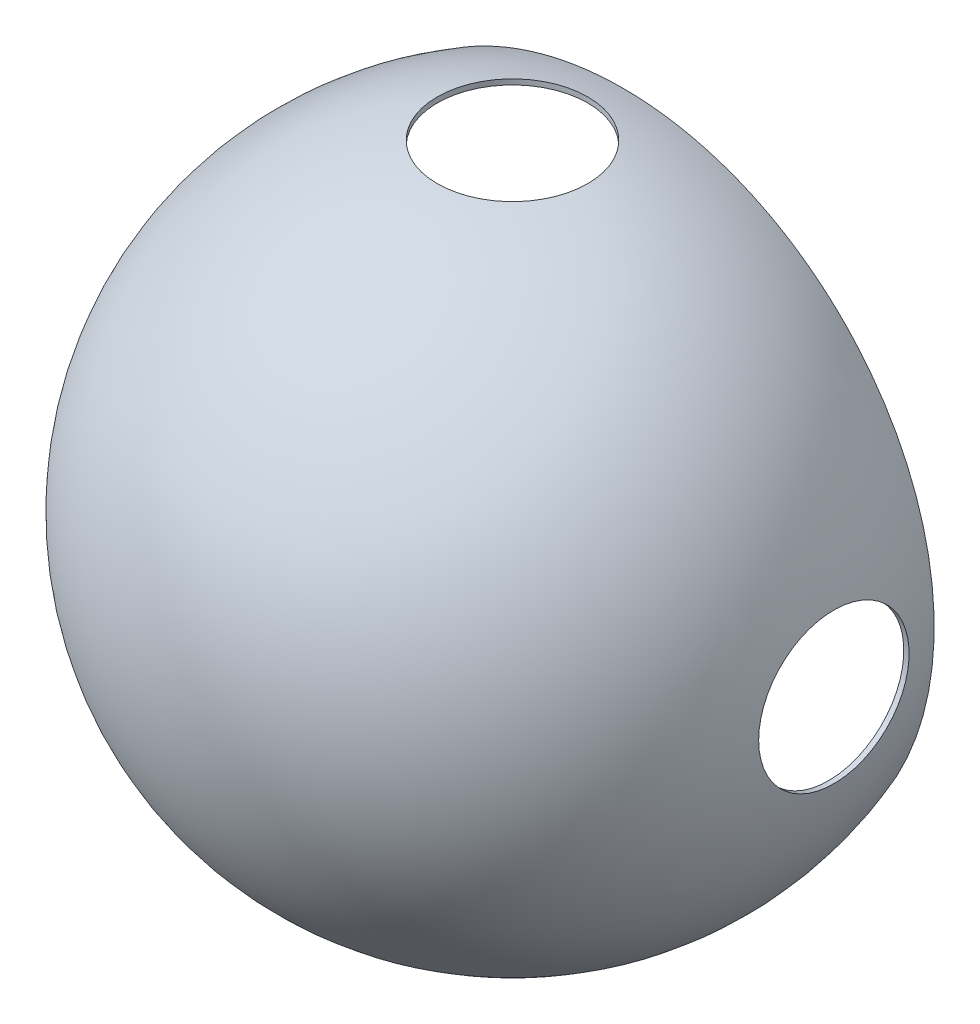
ISO-10303-21;
HEADER;
FILE_DESCRIPTION(('STEP AP214'),'2;1');
FILE_NAME('part.step','',(''),(''),'','','');
FILE_SCHEMA(('AUTOMOTIVE_DESIGN { 1 0 10303 214 1 1 1 1 }'));
ENDSEC;
DATA;
#1=APPLICATION_CONTEXT('core data for automotive mechanical design processes');
#2=APPLICATION_PROTOCOL_DEFINITION('international standard','automotive_design',2000,#1);
#3=PRODUCT_CONTEXT('',#1,'mechanical');
#4=PRODUCT('Part','Part','',(#3));
#5=PRODUCT_RELATED_PRODUCT_CATEGORY('part','',(#4));
#6=PRODUCT_DEFINITION_FORMATION('','',#4);
#7=PRODUCT_DEFINITION_CONTEXT('part definition',#1,'design');
#8=PRODUCT_DEFINITION('design','',#6,#7);
#9=PRODUCT_DEFINITION_SHAPE('','',#8);
#10=(LENGTH_UNIT() NAMED_UNIT(*) SI_UNIT(.MILLI.,.METRE.));
#11=(NAMED_UNIT(*) PLANE_ANGLE_UNIT() SI_UNIT($,.RADIAN.));
#12=(NAMED_UNIT(*) SI_UNIT($,.STERADIAN.) SOLID_ANGLE_UNIT());
#13=UNCERTAINTY_MEASURE_WITH_UNIT(LENGTH_MEASURE(1.E-05),#10,'distance_accuracy_value','');
#14=(GEOMETRIC_REPRESENTATION_CONTEXT(3) GLOBAL_UNCERTAINTY_ASSIGNED_CONTEXT((#13)) GLOBAL_UNIT_ASSIGNED_CONTEXT((#10,
#11,#12)) REPRESENTATION_CONTEXT('',''));
#15=CARTESIAN_POINT('',(0.,0.,0.));
#16=DIRECTION('',(0.,0.,1.));
#17=DIRECTION('',(1.,0.,0.));
#18=AXIS2_PLACEMENT_3D('',#15,#16,#17);
#19=CARTESIAN_POINT('',(2.4980018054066E-13,2.4980018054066E-13,0.));
#20=DIRECTION('',(-0.707106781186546,-0.707106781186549,0.));
#21=DIRECTION('',(0.707106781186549,-0.707106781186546,0.));
#22=AXIS2_PLACEMENT_3D('',#19,#20,#21);
#23=TOROIDAL_SURFACE('',#22,100.0125,3.175);
#24=CARTESIAN_POINT('',(-2.24478118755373,-2.24478118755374,0.));
#25=DIRECTION('',(-0.707106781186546,-0.707106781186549,0.));
#26=DIRECTION('',(0.707106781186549,-0.707106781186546,0.));
#27=AXIS2_PLACEMENT_3D('',#24,#25,#26);
#28=CIRCLE('',#27,99.9621031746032);
#29=CARTESIAN_POINT('',(64.9724812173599,-69.4620435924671,-30.9208884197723));
#30=VERTEX_POINT('',#29);
#31=CARTESIAN_POINT('',(-69.4620435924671,64.9724812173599,-30.9208884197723));
#32=VERTEX_POINT('',#31);
#33=EDGE_CURVE('E83',#30,#32,#28,.T.);
#34=ORIENTED_EDGE('',*,*,#33,.T.);
#35=CARTESIAN_POINT('',(-67.1710007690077,63.9959230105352,-30.9208884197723));
#36=CARTESIAN_POINT('',(-66.9942054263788,63.9912670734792,-30.9208884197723));
#37=CARTESIAN_POINT('',(-66.8169423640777,64.0009764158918,-30.9208884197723));
#38=CARTESIAN_POINT('',(-66.4663612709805,64.0496674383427,-30.9208884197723));
#39=CARTESIAN_POINT('',(-66.2930458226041,64.0886677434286,-30.9208884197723));
#40=CARTESIAN_POINT('',(-65.9552613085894,64.1956447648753,-30.9208884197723));
#41=CARTESIAN_POINT('',(-65.7908059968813,64.2636651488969,-30.9208884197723));
#42=CARTESIAN_POINT('',(-65.4762086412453,64.4272050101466,-30.9208884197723));
#43=CARTESIAN_POINT('',(-65.3260626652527,64.522716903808,-30.9208884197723));
#44=CARTESIAN_POINT('',(-65.0490542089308,64.7353837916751,-30.9208884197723));
#45=CARTESIAN_POINT('',(-64.9216315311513,64.8518096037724,-30.9208884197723));
#46=CARTESIAN_POINT('',(-64.6885399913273,65.1046969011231,-30.9208884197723));
#47=CARTESIAN_POINT('',(-64.582869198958,65.2411566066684,-30.9208884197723));
#48=CARTESIAN_POINT('',(-64.3976071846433,65.5278264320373,-30.9208884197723));
#49=CARTESIAN_POINT('',(-64.317648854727,65.6777998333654,-30.9208884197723));
#50=CARTESIAN_POINT('',(-64.1835100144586,65.9888428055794,-30.9208884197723));
#51=CARTESIAN_POINT('',(-64.1293310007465,66.1499130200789,-30.9208884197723));
#52=CARTESIAN_POINT('',(-64.0468454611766,66.4819335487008,-30.9208884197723));
#53=CARTESIAN_POINT('',(-64.0190754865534,66.6530167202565,-30.9208884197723));
#54=CARTESIAN_POINT('',(-63.9913391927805,66.9974059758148,-30.9208884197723));
#55=CARTESIAN_POINT('',(-63.9913781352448,67.1707124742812,-30.9208884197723));
#56=CARTESIAN_POINT('',(-64.0191839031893,67.5228611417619,-30.9208884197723));
#57=CARTESIAN_POINT('',(-64.0481876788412,67.7016053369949,-30.9208884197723));
#58=CARTESIAN_POINT('',(-64.1343318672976,68.0521717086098,-30.9208884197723));
#59=CARTESIAN_POINT('',(-64.191479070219,68.2239922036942,-30.9208884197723));
#60=CARTESIAN_POINT('',(-64.3354580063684,68.5648495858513,-30.9208884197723));
#61=CARTESIAN_POINT('',(-64.4236245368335,68.7333231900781,-30.9208884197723));
#62=CARTESIAN_POINT('',(-64.6260878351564,69.0537684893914,-30.9208884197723));
#63=CARTESIAN_POINT('',(-64.7403900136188,69.2057367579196,-30.9208884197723));
#64=CARTESIAN_POINT('',(-64.9962788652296,69.4940972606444,-30.9208884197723));
#65=CARTESIAN_POINT('',(-65.138660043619,69.6297856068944,-30.9208884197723));
#66=CARTESIAN_POINT('',(-65.4441096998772,69.875478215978,-30.9208884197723));
#67=CARTESIAN_POINT('',(-65.6071798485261,69.985480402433,-30.9208884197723));
#68=CARTESIAN_POINT('',(-65.9502315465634,70.1767145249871,-30.9208884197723));
#69=CARTESIAN_POINT('',(-66.1302738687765,70.2578376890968,-30.9208884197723));
#70=CARTESIAN_POINT('',(-66.5016940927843,70.3877564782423,-30.9208884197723));
#71=CARTESIAN_POINT('',(-66.6930706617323,70.4365558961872,-30.9208884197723));
#72=CARTESIAN_POINT('',(-67.0760453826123,70.4986648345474,-30.9208884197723));
#73=CARTESIAN_POINT('',(-67.2674885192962,70.5129261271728,-30.9208884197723));
#74=CARTESIAN_POINT('',(-67.6499040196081,70.5074527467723,-30.9208884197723));
#75=CARTESIAN_POINT('',(-67.8408764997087,70.4877275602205,-30.9208884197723));
#76=CARTESIAN_POINT('',(-68.2074277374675,70.4158061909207,-30.9208884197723));
#77=CARTESIAN_POINT('',(-68.3833098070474,70.3651561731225,-30.9208884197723));
#78=CARTESIAN_POINT('',(-68.7234225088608,70.2337063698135,-30.9208884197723));
#79=CARTESIAN_POINT('',(-68.8876564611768,70.1529152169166,-30.9208884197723));
#80=CARTESIAN_POINT('',(-69.1923319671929,69.9674474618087,-30.9208884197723));
#81=CARTESIAN_POINT('',(-69.3334953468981,69.8639550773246,-30.9208884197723));
#82=CARTESIAN_POINT('',(-69.5959265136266,69.634254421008,-30.9208884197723));
#83=CARTESIAN_POINT('',(-69.71719744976,69.5080497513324,-30.9208884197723));
#84=CARTESIAN_POINT('',(-69.9338977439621,69.2396359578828,-30.9208884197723));
#85=CARTESIAN_POINT('',(-70.0298272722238,69.0978299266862,-30.9208884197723));
#86=CARTESIAN_POINT('',(-70.1967088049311,68.8002295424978,-30.9208884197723));
#87=CARTESIAN_POINT('',(-70.2676607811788,68.6444351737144,-30.9208884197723));
#88=CARTESIAN_POINT('',(-70.3834569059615,68.3220683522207,-30.9208884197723));
#89=CARTESIAN_POINT('',(-70.4280917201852,68.1554208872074,-30.9208884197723));
#90=CARTESIAN_POINT('',(-70.4897152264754,67.8171068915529,-30.9208884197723));
#91=CARTESIAN_POINT('',(-70.5067002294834,67.6454396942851,-30.9208884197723));
#92=CARTESIAN_POINT('',(-70.5132943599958,67.2959188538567,-30.9208884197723));
#93=CARTESIAN_POINT('',(-70.5019805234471,67.1180481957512,-30.9208884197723));
#94=CARTESIAN_POINT('',(-70.4510035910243,66.7664289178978,-30.9208884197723));
#95=CARTESIAN_POINT('',(-70.4113345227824,66.5926811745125,-30.9208884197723));
#96=CARTESIAN_POINT('',(-70.3028151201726,66.2458230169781,-30.9208884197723));
#97=CARTESIAN_POINT('',(-70.2327162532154,66.0731031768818,-30.9208884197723));
#98=CARTESIAN_POINT('',(-70.0656478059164,65.7411984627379,-30.9208884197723));
#99=CARTESIAN_POINT('',(-69.9686732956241,65.5820160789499,-30.9208884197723));
#100=CARTESIAN_POINT('',(-69.7461941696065,65.2749152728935,-30.9208884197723));
#101=CARTESIAN_POINT('',(-69.6196847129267,65.1277240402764,-30.9208884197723));
#102=CARTESIAN_POINT('',(-69.3441403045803,64.8561007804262,-30.9208884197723));
#103=CARTESIAN_POINT('',(-69.1950966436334,64.7316775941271,-30.9208884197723));
#104=CARTESIAN_POINT('',(-68.8754026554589,64.5069180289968,-30.9208884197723));
#105=CARTESIAN_POINT('',(-68.7043847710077,64.4071039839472,-30.9208884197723));
#106=CARTESIAN_POINT('',(-68.3479642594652,64.2381144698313,-30.9208884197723));
#107=CARTESIAN_POINT('',(-68.162578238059,64.168904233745,-30.9208884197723));
#108=CARTESIAN_POINT('',(-67.842135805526,64.0801252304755,-30.9208884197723));
#109=CARTESIAN_POINT('',(-67.7094437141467,64.051803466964,-30.9208884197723));
#110=CARTESIAN_POINT('',(-67.4415927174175,64.0114862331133,-30.9208884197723));
#111=CARTESIAN_POINT('',(-67.3064339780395,63.9994896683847,-30.9208884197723));
#112=CARTESIAN_POINT('',(-67.1710007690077,63.9959230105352,-30.9208884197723));
#113=B_SPLINE_CURVE_WITH_KNOTS('',3,(#35,#36,#37,#38,#39,#40,#41,#42,#43,#44,#45,#46,#47,#48,
#49,#50,#51,#52,#53,#54,#55,#56,#57,#58,#59,#60,#61,#62,#63,#64,#65,#66,#67,#68,#69,#70,#71,#72,
#73,#74,#75,#76,#77,#78,#79,#80,#81,#82,#83,#84,#85,#86,#87,#88,#89,#90,#91,#92,#93,#94,#95,#96,
#97,#98,#99,#100,#101,#102,#103,#104,#105,#106,#107,#108,#109,#110,#111,#112),.UNSPECIFIED.,.T.,
.F.,(4,2,2,2,2,2,2,2,2,2,2,2,2,2,2,2,2,2,2,2,2,2,2,2,2,2,2,2,2,2,2,2,2,2,2,2,2,2,4),(0.,
0.530108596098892,1.06055455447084,1.59180152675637,2.12290209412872,2.63818753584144,
3.15342722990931,3.66094529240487,4.16849281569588,4.68614475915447,5.20389464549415,
5.74474297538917,6.28572185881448,6.85360170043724,7.42159921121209,8.0088785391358,
8.59620532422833,9.18572141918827,9.77516832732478,10.3481770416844,10.9210258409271,
11.4673438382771,12.013505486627,12.5360448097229,13.0585013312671,13.5697089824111,
14.0809172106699,14.5961387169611,15.1114289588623,15.6437430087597,16.1761692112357,
16.7328814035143,17.289695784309,17.8692887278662,18.4491062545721,19.0403369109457,
19.6308941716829,20.0370084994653,20.4430956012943),.UNSPECIFIED.);
#114=CARTESIAN_POINT('',(-64.9724812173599,69.4620435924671,-30.9208884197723));
#115=VERTEX_POINT('',#114);
#116=EDGE_CURVE('E74',#32,#115,#113,.T.);
#117=ORIENTED_EDGE('',*,*,#116,.T.);
#118=CARTESIAN_POINT('',(2.24478118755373,2.24478118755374,0.));
#119=DIRECTION('',(0.707106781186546,0.707106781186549,0.));
#120=DIRECTION('',(-0.707106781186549,0.707106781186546,0.));
#121=AXIS2_PLACEMENT_3D('',#118,#119,#120);
#122=CIRCLE('',#121,99.9621031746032);
#123=CARTESIAN_POINT('',(69.4620435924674,-64.9724812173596,-30.9208884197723));
#124=VERTEX_POINT('',#123);
#125=EDGE_CURVE('E82',#115,#124,#122,.T.);
#126=ORIENTED_EDGE('',*,*,#125,.T.);
#127=CARTESIAN_POINT('',(63.9959230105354,-67.1710007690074,-30.9208884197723));
#128=CARTESIAN_POINT('',(64.0009427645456,-67.3610367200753,-30.9208884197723));
#129=CARTESIAN_POINT('',(64.0225763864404,-67.5508168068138,-30.9208884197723));
#130=CARTESIAN_POINT('',(64.0976638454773,-67.9241817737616,-30.9208884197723));
#131=CARTESIAN_POINT('',(64.1511768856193,-68.1077544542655,-30.9208884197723));
#132=CARTESIAN_POINT('',(64.2877154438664,-68.4630953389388,-30.9208884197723));
#133=CARTESIAN_POINT('',(64.3706744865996,-68.6348891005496,-30.9208884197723));
#134=CARTESIAN_POINT('',(64.5634156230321,-68.9625941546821,-30.9208884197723));
#135=CARTESIAN_POINT('',(64.6731892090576,-69.1185104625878,-30.9208884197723));
#136=CARTESIAN_POINT('',(64.9200210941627,-69.4147756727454,-30.9208884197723));
#137=CARTESIAN_POINT('',(65.0577755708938,-69.5545452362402,-30.9208884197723));
#138=CARTESIAN_POINT('',(65.3546630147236,-69.8092188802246,-30.9208884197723));
#139=CARTESIAN_POINT('',(65.513799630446,-69.9241187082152,-30.9208884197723));
#140=CARTESIAN_POINT('',(65.8503235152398,-70.1262329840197,-30.9208884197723));
#141=CARTESIAN_POINT('',(66.0278299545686,-70.2132494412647,-30.9208884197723));
#142=CARTESIAN_POINT('',(66.3952064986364,-70.355400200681,-30.9208884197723));
#143=CARTESIAN_POINT('',(66.5850753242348,-70.4105377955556,-30.9208884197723));
#144=CARTESIAN_POINT('',(66.9667026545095,-70.4855356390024,-30.9208884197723));
#145=CARTESIAN_POINT('',(67.1582923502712,-70.5062516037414,-30.9208884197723));
#146=CARTESIAN_POINT('',(67.5421406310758,-70.5135958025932,-30.9208884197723));
#147=CARTESIAN_POINT('',(67.7343990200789,-70.5002333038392,-30.9208884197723));
#148=CARTESIAN_POINT('',(68.1047373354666,-70.4404051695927,-30.9208884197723));
#149=CARTESIAN_POINT('',(68.2830645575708,-70.395471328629,-30.9208884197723));
#150=CARTESIAN_POINT('',(68.6290190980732,-70.2748955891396,-30.9208884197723));
#151=CARTESIAN_POINT('',(68.7966495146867,-70.1992626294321,-30.9208884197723));
#152=CARTESIAN_POINT('',(69.1085775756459,-70.0232539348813,-30.9208884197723));
#153=CARTESIAN_POINT('',(69.2535812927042,-69.9241279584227,-30.9208884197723));
#154=CARTESIAN_POINT('',(69.5243278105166,-69.7023739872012,-30.9208884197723));
#155=CARTESIAN_POINT('',(69.6500739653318,-69.5797500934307,-30.9208884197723));
#156=CARTESIAN_POINT('',(69.8757726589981,-69.3178755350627,-30.9208884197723));
#157=CARTESIAN_POINT('',(69.9762740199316,-69.1790970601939,-30.9208884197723));
#158=CARTESIAN_POINT('',(70.1526644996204,-68.8867098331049,-30.9208884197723));
#159=CARTESIAN_POINT('',(70.2285539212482,-68.7331012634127,-30.9208884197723));
#160=CARTESIAN_POINT('',(70.3542745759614,-68.4146856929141,-30.9208884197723));
#161=CARTESIAN_POINT('',(70.4039712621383,-68.2498256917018,-30.9208884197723));
#162=CARTESIAN_POINT('',(70.475884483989,-67.914234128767,-30.9208884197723));
#163=CARTESIAN_POINT('',(70.4980976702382,-67.7435018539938,-30.9208884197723));
#164=CARTESIAN_POINT('',(70.5153202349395,-67.3953612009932,-30.9208884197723));
#165=CARTESIAN_POINT('',(70.5094621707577,-67.2179103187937,-30.9208884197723));
#166=CARTESIAN_POINT('',(70.4693780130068,-66.8662552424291,-30.9208884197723));
#167=CARTESIAN_POINT('',(70.4351461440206,-66.6920517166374,-30.9208884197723));
#168=CARTESIAN_POINT('',(70.3376284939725,-66.34348466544,-30.9208884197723));
#169=CARTESIAN_POINT('',(70.2731019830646,-66.1694682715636,-30.9208884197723));
#170=CARTESIAN_POINT('',(70.1169261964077,-65.8340681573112,-30.9208884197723));
#171=CARTESIAN_POINT('',(70.0252708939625,-65.6726872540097,-30.9208884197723));
#172=CARTESIAN_POINT('',(69.813141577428,-65.3600211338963,-30.9208884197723));
#173=CARTESIAN_POINT('',(69.6916142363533,-65.2094497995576,-30.9208884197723));
#174=CARTESIAN_POINT('',(69.42550460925,-64.9302633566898,-30.9208884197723));
#175=CARTESIAN_POINT('',(69.2809184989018,-64.8016518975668,-30.9208884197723));
#176=CARTESIAN_POINT('',(68.9691873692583,-64.5673657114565,-30.9208884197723));
#177=CARTESIAN_POINT('',(68.8016175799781,-64.4622551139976,-30.9208884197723));
#178=CARTESIAN_POINT('',(68.4510593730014,-64.2819500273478,-30.9208884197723));
#179=CARTESIAN_POINT('',(68.2680707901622,-64.2067558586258,-30.9208884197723));
#180=CARTESIAN_POINT('',(67.89373049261,-64.0896734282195,-30.9208884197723));
#181=CARTESIAN_POINT('',(67.7024820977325,-64.0474559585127,-30.9208884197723));
#182=CARTESIAN_POINT('',(67.3155207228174,-63.9971783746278,-30.9208884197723));
#183=CARTESIAN_POINT('',(67.1198086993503,-63.9891110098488,-30.9208884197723));
#184=CARTESIAN_POINT('',(66.7379915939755,-64.0079629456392,-30.9208884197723));
#185=CARTESIAN_POINT('',(66.5518180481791,-64.0334807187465,-30.9208884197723));
#186=CARTESIAN_POINT('',(66.1869565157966,-64.1171840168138,-30.9208884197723));
#187=CARTESIAN_POINT('',(66.0082659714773,-64.1753582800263,-30.9208884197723));
#188=CARTESIAN_POINT('',(65.6734296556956,-64.3193244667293,-30.9208884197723));
#189=CARTESIAN_POINT('',(65.5165934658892,-64.4035120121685,-30.9208884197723));
#190=CARTESIAN_POINT('',(65.2200765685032,-64.5980127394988,-30.9208884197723));
#191=CARTESIAN_POINT('',(65.0803906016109,-64.7083178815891,-30.9208884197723));
#192=CARTESIAN_POINT('',(64.8274929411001,-64.9471652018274,-30.9208884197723));
#193=CARTESIAN_POINT('',(64.713480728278,-65.0748614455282,-30.9208884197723));
#194=CARTESIAN_POINT('',(64.5086341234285,-65.3476998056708,-30.9208884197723));
#195=CARTESIAN_POINT('',(64.4178044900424,-65.492845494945,-30.9208884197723));
#196=CARTESIAN_POINT('',(64.2619888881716,-65.7955811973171,-30.9208884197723));
#197=CARTESIAN_POINT('',(64.1968961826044,-65.953116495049,-30.9208884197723));
#198=CARTESIAN_POINT('',(64.0933540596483,-66.2765458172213,-30.9208884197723));
#199=CARTESIAN_POINT('',(64.0548737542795,-66.4424299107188,-30.9208884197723));
#200=CARTESIAN_POINT('',(64.0160187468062,-66.7029411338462,-30.9208884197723));
#201=CARTESIAN_POINT('',(64.006299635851,-66.7962767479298,-30.9208884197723));
#202=CARTESIAN_POINT('',(63.995013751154,-66.9834292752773,-30.9208884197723));
#203=CARTESIAN_POINT('',(63.9934465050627,-67.0772461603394,-30.9208884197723));
#204=CARTESIAN_POINT('',(63.9959230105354,-67.1710007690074,-30.9208884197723));
#205=B_SPLINE_CURVE_WITH_KNOTS('',3,(#127,#128,#129,#130,#131,#132,#133,#134,#135,#136,#137,
#138,#139,#140,#141,#142,#143,#144,#145,#146,#147,#148,#149,#150,#151,#152,#153,#154,#155,#156,
#157,#158,#159,#160,#161,#162,#163,#164,#165,#166,#167,#168,#169,#170,#171,#172,#173,#174,#175,
#176,#177,#178,#179,#180,#181,#182,#183,#184,#185,#186,#187,#188,#189,#190,#191,#192,#193,#194,
#195,#196,#197,#198,#199,#200,#201,#202,#203,#204),.UNSPECIFIED.,.T.,.F.,(4,2,2,2,2,2,2,2,2,2,2,
2,2,2,2,2,2,2,2,2,2,2,2,2,2,2,2,2,2,2,2,2,2,2,2,2,2,2,4),(0.,0.569947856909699,1.14095747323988,
1.71068612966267,2.2802342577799,2.86622419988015,3.45231426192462,4.04247819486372,
4.63258116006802,5.20778190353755,5.78282624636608,6.33174062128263,6.88049528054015,
7.40484896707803,7.9291112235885,8.44073263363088,8.95234774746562,9.46656592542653,
9.9808467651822,10.5111202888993,11.0415017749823,11.5958040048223,12.1502294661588,
12.7280622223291,13.3059909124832,13.8965789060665,14.487173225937,15.0717934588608,
15.6562895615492,16.2171510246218,16.777819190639,17.3091502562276,17.8403179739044,
18.3514282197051,18.8626432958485,19.3717154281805,19.8801957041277,20.1613968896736,
20.4425817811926),.UNSPECIFIED.);
#206=EDGE_CURVE('E60',#124,#30,#205,.T.);
#207=ORIENTED_EDGE('',*,*,#206,.T.);
#208=EDGE_LOOP('',(#34,#117,#126,#207));
#209=FACE_BOUND('',#208,.T.);
#210=ADVANCED_FACE('F44',(#209),#23,.T.);
#211=CARTESIAN_POINT('',(0.,0.,0.));
#212=DIRECTION('',(0.,1.,0.));
#213=DIRECTION('',(1.,0.,0.));
#214=AXIS2_PLACEMENT_3D('',#211,#212,#213);
#215=SPHERICAL_SURFACE('',#214,100.0125);
#216=CARTESIAN_POINT('',(0.,0.,-30.9208884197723));
#217=DIRECTION('',(0.,0.,1.));
#218=DIRECTION('',(1.,0.,0.));
#219=AXIS2_PLACEMENT_3D('',#216,#217,#218);
#220=CIRCLE('',#219,95.1125586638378);
#221=EDGE_CURVE('E71',#115,#32,#220,.T.);
#222=ORIENTED_EDGE('',*,*,#221,.T.);
#223=ORIENTED_EDGE('',*,*,#33,.F.);
#224=EDGE_CURVE('E63',#30,#124,#220,.T.);
#225=ORIENTED_EDGE('',*,*,#224,.T.);
#226=ORIENTED_EDGE('',*,*,#125,.F.);
#227=EDGE_LOOP('',(#222,#223,#225,#226));
#228=FACE_BOUND('',#227,.T.);
#229=CARTESIAN_POINT('',(0.,97.2958396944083,0.));
#230=DIRECTION('',(0.,-1.,0.));
#231=DIRECTION('',(0.,0.,-1.));
#232=AXIS2_PLACEMENT_3D('',#229,#230,#231);
#233=CIRCLE('',#232,23.1521);
#234=CARTESIAN_POINT('',(0.,97.2958396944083,-23.1521));
#235=VERTEX_POINT('',#234);
#236=EDGE_CURVE('E107',#235,#235,#233,.F.);
#237=ORIENTED_EDGE('',*,*,#236,.T.);
#238=EDGE_LOOP('',(#237));
#239=FACE_BOUND('',#238,.T.);
#240=CARTESIAN_POINT('',(97.2958396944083,0.,0.));
#241=DIRECTION('',(-1.,0.,0.));
#242=DIRECTION('',(0.,0.,1.));
#243=AXIS2_PLACEMENT_3D('',#240,#241,#242);
#244=CIRCLE('',#243,23.1521);
#245=CARTESIAN_POINT('',(97.2958396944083,0.,23.1521));
#246=VERTEX_POINT('',#245);
#247=EDGE_CURVE('E92',#246,#246,#244,.F.);
#248=ORIENTED_EDGE('',*,*,#247,.T.);
#249=EDGE_LOOP('',(#248));
#250=FACE_BOUND('',#249,.T.);
#251=CARTESIAN_POINT('',(0.,0.,-34.0958884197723));
#252=DIRECTION('',(0.,0.,-1.));
#253=DIRECTION('',(0.,1.,0.));
#254=AXIS2_PLACEMENT_3D('',#251,#252,#253);
#255=CIRCLE('',#254,94.0211175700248);
#256=CARTESIAN_POINT('',(0.,94.0211175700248,-34.0958884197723));
#257=VERTEX_POINT('',#256);
#258=EDGE_CURVE('E53',#257,#257,#255,.F.);
#259=ORIENTED_EDGE('',*,*,#258,.F.);
#260=EDGE_LOOP('',(#259));
#261=FACE_BOUND('',#260,.T.);
#262=CARTESIAN_POINT('',(0.,-97.2958396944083,0.));
#263=DIRECTION('',(0.,1.,0.));
#264=DIRECTION('',(0.,0.,1.));
#265=AXIS2_PLACEMENT_3D('',#262,#263,#264);
#266=CIRCLE('',#265,23.1521);
#267=CARTESIAN_POINT('',(0.,-97.2958396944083,23.1521));
#268=VERTEX_POINT('',#267);
#269=EDGE_CURVE('E101',#268,#268,#266,.F.);
#270=ORIENTED_EDGE('',*,*,#269,.T.);
#271=EDGE_LOOP('',(#270));
#272=FACE_BOUND('',#271,.T.);
#273=CARTESIAN_POINT('',(-97.2958396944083,0.,0.));
#274=DIRECTION('',(1.,0.,0.));
#275=DIRECTION('',(0.,0.,-1.));
#276=AXIS2_PLACEMENT_3D('',#273,#274,#275);
#277=CIRCLE('',#276,23.1521);
#278=CARTESIAN_POINT('',(-97.2958396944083,0.,-23.1521));
#279=VERTEX_POINT('',#278);
#280=EDGE_CURVE('E88',#279,#279,#277,.F.);
#281=ORIENTED_EDGE('',*,*,#280,.T.);
#282=EDGE_LOOP('',(#281));
#283=FACE_BOUND('',#282,.T.);
#284=ADVANCED_FACE('F86',(#228,#239,#250,#261,#272,#283),#215,.F.);
#285=CARTESIAN_POINT('',(566.940905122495,98.4284962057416,-34.0958884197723));
#286=DIRECTION('',(0.,0.,-1.));
#287=DIRECTION('',(0.,1.,0.));
#288=AXIS2_PLACEMENT_3D('',#285,#286,#287);
#289=PLANE('',#288);
#290=ORIENTED_EDGE('',*,*,#258,.T.);
#291=EDGE_LOOP('',(#290));
#292=FACE_BOUND('',#291,.T.);
#293=CARTESIAN_POINT('',(0.,0.,-34.0958884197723));
#294=DIRECTION('',(0.,0.,-1.));
#295=DIRECTION('',(0.,1.,0.));
#296=AXIS2_PLACEMENT_3D('',#293,#294,#295);
#297=CIRCLE('',#296,95.7080476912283);
#298=CARTESIAN_POINT('',(0.,95.7080476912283,-34.0958884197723));
#299=VERTEX_POINT('',#298);
#300=EDGE_CURVE('E13',#299,#299,#297,.T.);
#301=ORIENTED_EDGE('',*,*,#300,.T.);
#302=EDGE_LOOP('',(#301));
#303=FACE_BOUND('',#302,.T.);
#304=ADVANCED_FACE('F146',(#292,#303),#289,.T.);
#305=CARTESIAN_POINT('',(0.,0.,0.));
#306=DIRECTION('',(0.,1.,0.));
#307=DIRECTION('',(-1.,0.,0.));
#308=AXIS2_PLACEMENT_3D('',#305,#306,#307);
#309=SPHERICAL_SURFACE('',#308,101.6);
#310=CARTESIAN_POINT('',(0.,98.9269440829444,0.));
#311=DIRECTION('',(0.,-1.,0.));
#312=DIRECTION('',(0.,0.,-1.));
#313=AXIS2_PLACEMENT_3D('',#310,#311,#312);
#314=CIRCLE('',#313,23.1521);
#315=CARTESIAN_POINT('',(0.,98.9269440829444,-23.1521));
#316=VERTEX_POINT('',#315);
#317=EDGE_CURVE('E48',#316,#316,#314,.T.);
#318=ORIENTED_EDGE('',*,*,#317,.T.);
#319=EDGE_LOOP('',(#318));
#320=FACE_BOUND('',#319,.T.);
#321=CARTESIAN_POINT('',(0.,-98.9269440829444,0.));
#322=DIRECTION('',(0.,1.,0.));
#323=DIRECTION('',(0.,0.,1.));
#324=AXIS2_PLACEMENT_3D('',#321,#322,#323);
#325=CIRCLE('',#324,23.1521);
#326=CARTESIAN_POINT('',(0.,-98.9269440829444,23.1521));
#327=VERTEX_POINT('',#326);
#328=EDGE_CURVE('E84',#327,#327,#325,.T.);
#329=ORIENTED_EDGE('',*,*,#328,.T.);
#330=EDGE_LOOP('',(#329));
#331=FACE_BOUND('',#330,.T.);
#332=CARTESIAN_POINT('',(98.9269440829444,0.,0.));
#333=DIRECTION('',(-1.,0.,0.));
#334=DIRECTION('',(0.,0.,1.));
#335=AXIS2_PLACEMENT_3D('',#332,#333,#334);
#336=CIRCLE('',#335,23.1521);
#337=CARTESIAN_POINT('',(98.9269440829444,0.,23.1521));
#338=VERTEX_POINT('',#337);
#339=EDGE_CURVE('E100',#338,#338,#336,.T.);
#340=ORIENTED_EDGE('',*,*,#339,.T.);
#341=EDGE_LOOP('',(#340));
#342=FACE_BOUND('',#341,.T.);
#343=CARTESIAN_POINT('',(-98.9269440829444,0.,0.));
#344=DIRECTION('',(1.,0.,0.));
#345=DIRECTION('',(0.,0.,-1.));
#346=AXIS2_PLACEMENT_3D('',#343,#344,#345);
#347=CIRCLE('',#346,23.1521);
#348=CARTESIAN_POINT('',(-98.9269440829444,0.,-23.1521));
#349=VERTEX_POINT('',#348);
#350=EDGE_CURVE('E97',#349,#349,#347,.T.);
#351=ORIENTED_EDGE('',*,*,#350,.T.);
#352=EDGE_LOOP('',(#351));
#353=FACE_BOUND('',#352,.T.);
#354=ORIENTED_EDGE('',*,*,#300,.F.);
#355=EDGE_LOOP('',(#354));
#356=FACE_BOUND('',#355,.T.);
#357=ADVANCED_FACE('F46',(#320,#331,#342,#353,#356),#309,.T.);
#358=CARTESIAN_POINT('',(-107.95,0.,0.));
#359=DIRECTION('',(1.,0.,0.));
#360=DIRECTION('',(0.,0.,-1.));
#361=AXIS2_PLACEMENT_3D('',#358,#359,#360);
#362=CYLINDRICAL_SURFACE('',#361,23.1521);
#363=ORIENTED_EDGE('',*,*,#350,.F.);
#364=EDGE_LOOP('',(#363));
#365=FACE_BOUND('',#364,.T.);
#366=ORIENTED_EDGE('',*,*,#280,.F.);
#367=EDGE_LOOP('',(#366));
#368=FACE_BOUND('',#367,.T.);
#369=ADVANCED_FACE('F129',(#365,#368),#362,.F.);
#370=ORIENTED_EDGE('',*,*,#339,.F.);
#371=EDGE_LOOP('',(#370));
#372=FACE_BOUND('',#371,.T.);
#373=ORIENTED_EDGE('',*,*,#247,.F.);
#374=EDGE_LOOP('',(#373));
#375=FACE_BOUND('',#374,.T.);
#376=ADVANCED_FACE('F126',(#372,#375),#362,.F.);
#377=CARTESIAN_POINT('',(0.,-107.95,0.));
#378=DIRECTION('',(0.,1.,0.));
#379=DIRECTION('',(0.,0.,1.));
#380=AXIS2_PLACEMENT_3D('',#377,#378,#379);
#381=CYLINDRICAL_SURFACE('',#380,23.1521);
#382=ORIENTED_EDGE('',*,*,#328,.F.);
#383=EDGE_LOOP('',(#382));
#384=FACE_BOUND('',#383,.T.);
#385=ORIENTED_EDGE('',*,*,#269,.F.);
#386=EDGE_LOOP('',(#385));
#387=FACE_BOUND('',#386,.T.);
#388=ADVANCED_FACE('F128',(#384,#387),#381,.F.);
#389=ORIENTED_EDGE('',*,*,#317,.F.);
#390=EDGE_LOOP('',(#389));
#391=FACE_BOUND('',#390,.T.);
#392=ORIENTED_EDGE('',*,*,#236,.F.);
#393=EDGE_LOOP('',(#392));
#394=FACE_BOUND('',#393,.T.);
#395=ADVANCED_FACE('F136',(#391,#394),#381,.F.);
#396=CARTESIAN_POINT('',(0.,-95.1125586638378,-30.9208884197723));
#397=DIRECTION('',(0.,0.,1.));
#398=DIRECTION('',(1.,0.,0.));
#399=AXIS2_PLACEMENT_3D('',#396,#397,#398);
#400=PLANE('',#399);
#401=ORIENTED_EDGE('',*,*,#221,.F.);
#402=ORIENTED_EDGE('',*,*,#116,.F.);
#403=EDGE_LOOP('',(#401,#402));
#404=FACE_BOUND('',#403,.T.);
#405=ADVANCED_FACE('F73',(#404),#400,.F.);
#406=ORIENTED_EDGE('',*,*,#224,.F.);
#407=ORIENTED_EDGE('',*,*,#206,.F.);
#408=EDGE_LOOP('',(#406,#407));
#409=FACE_BOUND('',#408,.T.);
#410=ADVANCED_FACE('F153',(#409),#400,.F.);
#411=CLOSED_SHELL('',(#210,#284,#304,#357,#369,#376,#388,#395,#405,#410));
#412=MANIFOLD_SOLID_BREP('B2',#411);
#413=ADVANCED_BREP_SHAPE_REPRESENTATION('',(#18,#412),#14);
#414=SHAPE_DEFINITION_REPRESENTATION(#9,#413);
ENDSEC;
END-ISO-10303-21;
